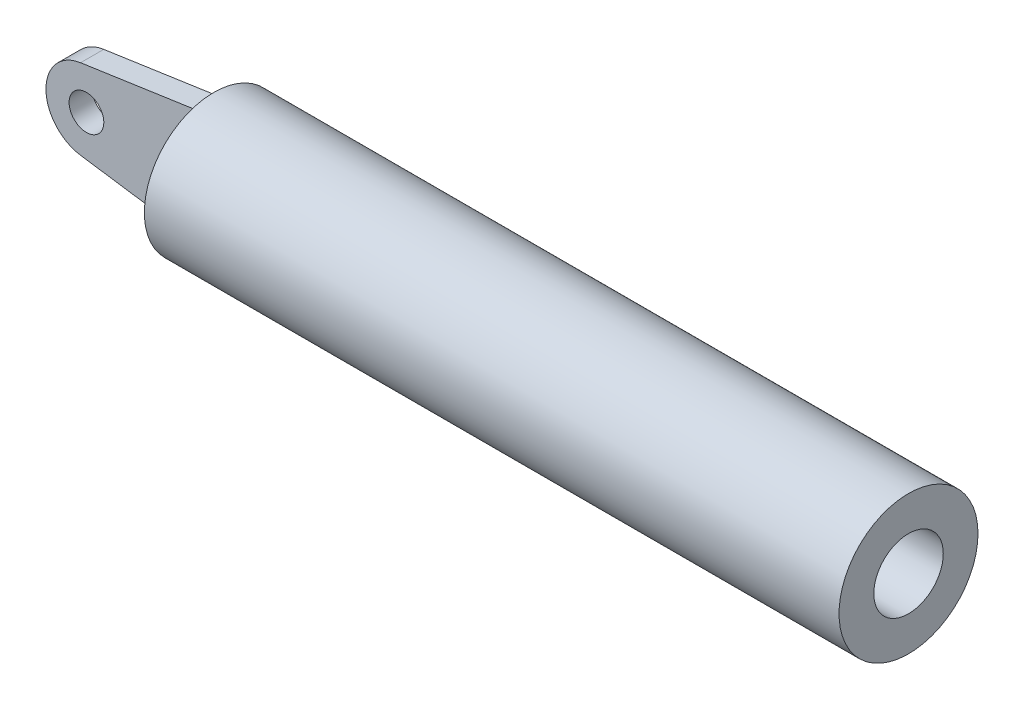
ISO-10303-21;
HEADER;
FILE_DESCRIPTION(('STEP AP214'),'2;1');
FILE_NAME('part.step','',(''),(''),'','','');
FILE_SCHEMA(('AUTOMOTIVE_DESIGN { 1 0 10303 214 1 1 1 1 }'));
ENDSEC;
DATA;
#1=APPLICATION_CONTEXT('core data for automotive mechanical design processes');
#2=APPLICATION_PROTOCOL_DEFINITION('international standard','automotive_design',2000,#1);
#3=PRODUCT_CONTEXT('',#1,'mechanical');
#4=PRODUCT('Part','Part','',(#3));
#5=PRODUCT_RELATED_PRODUCT_CATEGORY('part','',(#4));
#6=PRODUCT_DEFINITION_FORMATION('','',#4);
#7=PRODUCT_DEFINITION_CONTEXT('part definition',#1,'design');
#8=PRODUCT_DEFINITION('design','',#6,#7);
#9=PRODUCT_DEFINITION_SHAPE('','',#8);
#10=(LENGTH_UNIT() NAMED_UNIT(*) SI_UNIT(.MILLI.,.METRE.));
#11=(NAMED_UNIT(*) PLANE_ANGLE_UNIT() SI_UNIT($,.RADIAN.));
#12=(NAMED_UNIT(*) SI_UNIT($,.STERADIAN.) SOLID_ANGLE_UNIT());
#13=UNCERTAINTY_MEASURE_WITH_UNIT(LENGTH_MEASURE(1.E-05),#10,'distance_accuracy_value','');
#14=(GEOMETRIC_REPRESENTATION_CONTEXT(3) GLOBAL_UNCERTAINTY_ASSIGNED_CONTEXT((#13)) GLOBAL_UNIT_ASSIGNED_CONTEXT((#10,
#11,#12)) REPRESENTATION_CONTEXT('',''));
#15=CARTESIAN_POINT('',(0.,0.,0.));
#16=DIRECTION('',(0.,0.,1.));
#17=DIRECTION('',(1.,0.,0.));
#18=AXIS2_PLACEMENT_3D('',#15,#16,#17);
#19=CARTESIAN_POINT('',(600.,0.,0.));
#20=DIRECTION('',(-1.,0.,0.));
#21=DIRECTION('',(0.,0.,1.));
#22=AXIS2_PLACEMENT_3D('',#19,#20,#21);
#23=CYLINDRICAL_SURFACE('',#22,60.);
#24=CARTESIAN_POINT('',(600.,0.,0.));
#25=DIRECTION('',(1.,0.,0.));
#26=DIRECTION('',(0.,0.,-1.));
#27=AXIS2_PLACEMENT_3D('',#24,#25,#26);
#28=CIRCLE('',#27,60.);
#29=CARTESIAN_POINT('',(600.,0.,-60.));
#30=VERTEX_POINT('',#29);
#31=EDGE_CURVE('E11',#30,#30,#28,.T.);
#32=ORIENTED_EDGE('',*,*,#31,.F.);
#33=EDGE_LOOP('',(#32));
#34=FACE_BOUND('',#33,.T.);
#35=CARTESIAN_POINT('',(0.,0.,0.));
#36=DIRECTION('',(1.,0.,0.));
#37=DIRECTION('',(0.,0.,-1.));
#38=AXIS2_PLACEMENT_3D('',#35,#36,#37);
#39=CIRCLE('',#38,60.);
#40=CARTESIAN_POINT('',(0.,0.,-60.));
#41=VERTEX_POINT('',#40);
#42=EDGE_CURVE('E36',#41,#41,#39,.T.);
#43=ORIENTED_EDGE('',*,*,#42,.T.);
#44=EDGE_LOOP('',(#43));
#45=FACE_BOUND('',#44,.T.);
#46=ADVANCED_FACE('F33',(#34,#45),#23,.T.);
#47=CARTESIAN_POINT('',(600.,0.,0.));
#48=DIRECTION('',(1.,0.,0.));
#49=DIRECTION('',(0.,0.,-1.));
#50=AXIS2_PLACEMENT_3D('',#47,#48,#49);
#51=PLANE('',#50);
#52=CARTESIAN_POINT('',(600.,0.,0.));
#53=DIRECTION('',(1.,0.,0.));
#54=DIRECTION('',(0.,0.,-1.));
#55=AXIS2_PLACEMENT_3D('',#52,#53,#54);
#56=CIRCLE('',#55,30.);
#57=CARTESIAN_POINT('',(600.,0.,-30.));
#58=VERTEX_POINT('',#57);
#59=EDGE_CURVE('E113',#58,#58,#56,.T.);
#60=ORIENTED_EDGE('',*,*,#59,.F.);
#61=EDGE_LOOP('',(#60));
#62=FACE_BOUND('',#61,.T.);
#63=ORIENTED_EDGE('',*,*,#31,.T.);
#64=EDGE_LOOP('',(#63));
#65=FACE_BOUND('',#64,.T.);
#66=ADVANCED_FACE('F122',(#62,#65),#51,.T.);
#67=CARTESIAN_POINT('',(0.,0.,0.));
#68=DIRECTION('',(1.,0.,0.));
#69=DIRECTION('',(0.,0.,-1.));
#70=AXIS2_PLACEMENT_3D('',#67,#68,#69);
#71=PLANE('',#70);
#72=DIRECTION('',(0.,0.,-1.));
#73=VECTOR('',#72,1.);
#74=CARTESIAN_POINT('',(0.,-50.,10.));
#75=LINE('',#74,#73);
#76=CARTESIAN_POINT('',(0.,-50.,10.));
#77=VERTEX_POINT('',#76);
#78=CARTESIAN_POINT('',(0.,-50.,-10.));
#79=VERTEX_POINT('',#78);
#80=EDGE_CURVE('E95',#77,#79,#75,.T.);
#81=ORIENTED_EDGE('',*,*,#80,.T.);
#82=DIRECTION('',(0.,1.,0.));
#83=VECTOR('',#82,1.);
#84=CARTESIAN_POINT('',(0.,-50.,-10.));
#85=LINE('',#84,#83);
#86=CARTESIAN_POINT('',(0.,50.,-10.));
#87=VERTEX_POINT('',#86);
#88=EDGE_CURVE('E47',#79,#87,#85,.T.);
#89=ORIENTED_EDGE('',*,*,#88,.T.);
#90=DIRECTION('',(0.,0.,-1.));
#91=VECTOR('',#90,1.);
#92=CARTESIAN_POINT('',(0.,50.,10.));
#93=LINE('',#92,#91);
#94=CARTESIAN_POINT('',(0.,50.,10.));
#95=VERTEX_POINT('',#94);
#96=EDGE_CURVE('E73',#95,#87,#93,.T.);
#97=ORIENTED_EDGE('',*,*,#96,.F.);
#98=DIRECTION('',(0.,1.,0.));
#99=VECTOR('',#98,1.);
#100=CARTESIAN_POINT('',(0.,-50.,10.));
#101=LINE('',#100,#99);
#102=EDGE_CURVE('E56',#77,#95,#101,.T.);
#103=ORIENTED_EDGE('',*,*,#102,.F.);
#104=EDGE_LOOP('',(#81,#89,#97,#103));
#105=FACE_BOUND('',#104,.T.);
#106=ORIENTED_EDGE('',*,*,#42,.F.);
#107=EDGE_LOOP('',(#106));
#108=FACE_BOUND('',#107,.T.);
#109=ADVANCED_FACE('F125',(#105,#108),#71,.F.);
#110=CARTESIAN_POINT('',(20.,0.,0.));
#111=DIRECTION('',(1.,0.,0.));
#112=DIRECTION('',(0.,0.,-1.));
#113=AXIS2_PLACEMENT_3D('',#110,#111,#112);
#114=CYLINDRICAL_SURFACE('',#113,30.);
#115=CARTESIAN_POINT('',(20.,0.,0.));
#116=DIRECTION('',(1.,0.,0.));
#117=DIRECTION('',(0.,0.,-1.));
#118=AXIS2_PLACEMENT_3D('',#115,#116,#117);
#119=CIRCLE('',#118,30.);
#120=CARTESIAN_POINT('',(20.,0.,-30.));
#121=VERTEX_POINT('',#120);
#122=EDGE_CURVE('E114',#121,#121,#119,.T.);
#123=ORIENTED_EDGE('',*,*,#122,.F.);
#124=EDGE_LOOP('',(#123));
#125=FACE_BOUND('',#124,.T.);
#126=ORIENTED_EDGE('',*,*,#59,.T.);
#127=EDGE_LOOP('',(#126));
#128=FACE_BOUND('',#127,.T.);
#129=ADVANCED_FACE('F120',(#125,#128),#114,.F.);
#130=CARTESIAN_POINT('',(20.,0.,0.));
#131=DIRECTION('',(1.,0.,0.));
#132=DIRECTION('',(0.,0.,-1.));
#133=AXIS2_PLACEMENT_3D('',#130,#131,#132);
#134=PLANE('',#133);
#135=ORIENTED_EDGE('',*,*,#122,.T.);
#136=EDGE_LOOP('',(#135));
#137=FACE_BOUND('',#136,.T.);
#138=ADVANCED_FACE('F139',(#137),#134,.T.);
#139=CARTESIAN_POINT('',(-100.,0.,10.));
#140=DIRECTION('',(0.,0.,1.));
#141=DIRECTION('',(1.,0.,0.));
#142=AXIS2_PLACEMENT_3D('',#139,#140,#141);
#143=PLANE('',#142);
#144=DIRECTION('',(-0.989470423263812,-0.144735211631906,0.));
#145=VECTOR('',#144,1.);
#146=CARTESIAN_POINT('',(0.,50.,10.));
#147=LINE('',#146,#145);
#148=CARTESIAN_POINT('',(-105.065732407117,34.6314648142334,10.));
#149=VERTEX_POINT('',#148);
#150=EDGE_CURVE('E86',#95,#149,#147,.T.);
#151=ORIENTED_EDGE('',*,*,#150,.T.);
#152=CARTESIAN_POINT('',(-100.,0.,10.));
#153=DIRECTION('',(0.,0.,1.));
#154=DIRECTION('',(1.,0.,0.));
#155=AXIS2_PLACEMENT_3D('',#152,#153,#154);
#156=CIRCLE('',#155,35.);
#157=CARTESIAN_POINT('',(-105.065732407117,-34.6314648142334,10.));
#158=VERTEX_POINT('',#157);
#159=EDGE_CURVE('E80',#149,#158,#156,.T.);
#160=ORIENTED_EDGE('',*,*,#159,.T.);
#161=DIRECTION('',(0.989470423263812,-0.144735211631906,0.));
#162=VECTOR('',#161,1.);
#163=CARTESIAN_POINT('',(0.,-50.,10.));
#164=LINE('',#163,#162);
#165=EDGE_CURVE('E84',#158,#77,#164,.T.);
#166=ORIENTED_EDGE('',*,*,#165,.T.);
#167=ORIENTED_EDGE('',*,*,#102,.T.);
#168=EDGE_LOOP('',(#151,#160,#166,#167));
#169=FACE_BOUND('',#168,.T.);
#170=CARTESIAN_POINT('',(-100.,0.,10.));
#171=DIRECTION('',(0.,0.,1.));
#172=DIRECTION('',(1.,0.,0.));
#173=AXIS2_PLACEMENT_3D('',#170,#171,#172);
#174=CIRCLE('',#173,15.);
#175=CARTESIAN_POINT('',(-85.,0.,10.));
#176=VERTEX_POINT('',#175);
#177=EDGE_CURVE('E105',#176,#176,#174,.T.);
#178=ORIENTED_EDGE('',*,*,#177,.F.);
#179=EDGE_LOOP('',(#178));
#180=FACE_BOUND('',#179,.T.);
#181=ADVANCED_FACE('F81',(#169,#180),#143,.T.);
#182=CARTESIAN_POINT('',(-100.,0.,-10.));
#183=DIRECTION('',(0.,0.,1.));
#184=DIRECTION('',(1.,0.,0.));
#185=AXIS2_PLACEMENT_3D('',#182,#183,#184);
#186=PLANE('',#185);
#187=DIRECTION('',(-0.989470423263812,-0.144735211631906,0.));
#188=VECTOR('',#187,1.);
#189=CARTESIAN_POINT('',(0.,50.,-10.));
#190=LINE('',#189,#188);
#191=CARTESIAN_POINT('',(-105.065732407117,34.6314648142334,-10.));
#192=VERTEX_POINT('',#191);
#193=EDGE_CURVE('E103',#87,#192,#190,.T.);
#194=ORIENTED_EDGE('',*,*,#193,.F.);
#195=ORIENTED_EDGE('',*,*,#88,.F.);
#196=DIRECTION('',(0.989470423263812,-0.144735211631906,0.));
#197=VECTOR('',#196,1.);
#198=CARTESIAN_POINT('',(0.,-50.,-10.));
#199=LINE('',#198,#197);
#200=CARTESIAN_POINT('',(-105.065732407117,-34.6314648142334,-10.));
#201=VERTEX_POINT('',#200);
#202=EDGE_CURVE('E107',#201,#79,#199,.T.);
#203=ORIENTED_EDGE('',*,*,#202,.F.);
#204=CARTESIAN_POINT('',(-100.,0.,-10.));
#205=DIRECTION('',(0.,0.,1.));
#206=DIRECTION('',(1.,0.,0.));
#207=AXIS2_PLACEMENT_3D('',#204,#205,#206);
#208=CIRCLE('',#207,35.);
#209=EDGE_CURVE('E92',#192,#201,#208,.T.);
#210=ORIENTED_EDGE('',*,*,#209,.F.);
#211=EDGE_LOOP('',(#194,#195,#203,#210));
#212=FACE_BOUND('',#211,.T.);
#213=CARTESIAN_POINT('',(-100.,0.,-10.));
#214=DIRECTION('',(0.,0.,1.));
#215=DIRECTION('',(1.,0.,0.));
#216=AXIS2_PLACEMENT_3D('',#213,#214,#215);
#217=CIRCLE('',#216,15.);
#218=CARTESIAN_POINT('',(-85.,0.,-10.));
#219=VERTEX_POINT('',#218);
#220=EDGE_CURVE('E168',#219,#219,#217,.T.);
#221=ORIENTED_EDGE('',*,*,#220,.T.);
#222=EDGE_LOOP('',(#221));
#223=FACE_BOUND('',#222,.T.);
#224=ADVANCED_FACE('F149',(#212,#223),#186,.F.);
#225=CARTESIAN_POINT('',(0.,50.,10.));
#226=DIRECTION('',(0.144735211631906,-0.989470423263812,0.));
#227=DIRECTION('',(0.989470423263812,0.144735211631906,0.));
#228=AXIS2_PLACEMENT_3D('',#225,#226,#227);
#229=PLANE('',#228);
#230=ORIENTED_EDGE('',*,*,#193,.T.);
#231=DIRECTION('',(0.,0.,-1.));
#232=VECTOR('',#231,1.);
#233=CARTESIAN_POINT('',(-105.065732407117,34.6314648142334,10.));
#234=LINE('',#233,#232);
#235=EDGE_CURVE('E94',#149,#192,#234,.T.);
#236=ORIENTED_EDGE('',*,*,#235,.F.);
#237=ORIENTED_EDGE('',*,*,#150,.F.);
#238=ORIENTED_EDGE('',*,*,#96,.T.);
#239=EDGE_LOOP('',(#230,#236,#237,#238));
#240=FACE_BOUND('',#239,.T.);
#241=ADVANCED_FACE('F146',(#240),#229,.F.);
#242=CARTESIAN_POINT('',(-100.,0.,10.));
#243=DIRECTION('',(0.,0.,-1.));
#244=DIRECTION('',(-1.,0.,0.));
#245=AXIS2_PLACEMENT_3D('',#242,#243,#244);
#246=CYLINDRICAL_SURFACE('',#245,35.);
#247=ORIENTED_EDGE('',*,*,#209,.T.);
#248=DIRECTION('',(0.,0.,-1.));
#249=VECTOR('',#248,1.);
#250=CARTESIAN_POINT('',(-105.065732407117,-34.6314648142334,10.));
#251=LINE('',#250,#249);
#252=EDGE_CURVE('E90',#158,#201,#251,.T.);
#253=ORIENTED_EDGE('',*,*,#252,.F.);
#254=ORIENTED_EDGE('',*,*,#159,.F.);
#255=ORIENTED_EDGE('',*,*,#235,.T.);
#256=EDGE_LOOP('',(#247,#253,#254,#255));
#257=FACE_BOUND('',#256,.T.);
#258=ADVANCED_FACE('F91',(#257),#246,.T.);
#259=CARTESIAN_POINT('',(0.,-50.,10.));
#260=DIRECTION('',(0.144735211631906,0.989470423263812,0.));
#261=DIRECTION('',(-0.989470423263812,0.144735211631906,0.));
#262=AXIS2_PLACEMENT_3D('',#259,#260,#261);
#263=PLANE('',#262);
#264=ORIENTED_EDGE('',*,*,#202,.T.);
#265=ORIENTED_EDGE('',*,*,#80,.F.);
#266=ORIENTED_EDGE('',*,*,#165,.F.);
#267=ORIENTED_EDGE('',*,*,#252,.T.);
#268=EDGE_LOOP('',(#264,#265,#266,#267));
#269=FACE_BOUND('',#268,.T.);
#270=ADVANCED_FACE('F97',(#269),#263,.F.);
#271=CARTESIAN_POINT('',(-100.,0.,10.));
#272=DIRECTION('',(0.,0.,-1.));
#273=DIRECTION('',(-1.,0.,0.));
#274=AXIS2_PLACEMENT_3D('',#271,#272,#273);
#275=CYLINDRICAL_SURFACE('',#274,15.);
#276=ORIENTED_EDGE('',*,*,#177,.T.);
#277=EDGE_LOOP('',(#276));
#278=FACE_BOUND('',#277,.T.);
#279=ORIENTED_EDGE('',*,*,#220,.F.);
#280=EDGE_LOOP('',(#279));
#281=FACE_BOUND('',#280,.T.);
#282=ADVANCED_FACE('F154',(#278,#281),#275,.F.);
#283=CLOSED_SHELL('',(#46,#66,#109,#129,#138,#181,#224,#241,#258,#270,#282));
#284=MANIFOLD_SOLID_BREP('B2',#283);
#285=ADVANCED_BREP_SHAPE_REPRESENTATION('',(#18,#284),#14);
#286=SHAPE_DEFINITION_REPRESENTATION(#9,#285);
ENDSEC;
END-ISO-10303-21;
